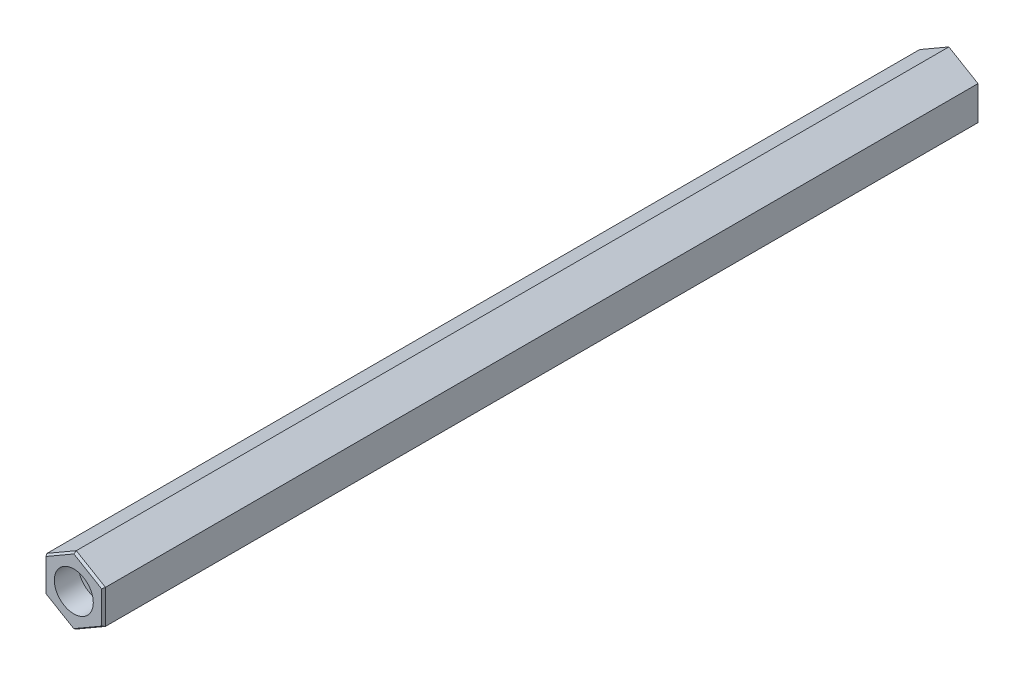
from build123d import *
from OCP.BRepFilletAPI import BRepFilletAPI_MakeChamfer

# Parameters (mm, degrees)
BASE_EXTRUSION_DEPTH    = 180
CHANFREIN1_SIZE         = 1
CHANFREIN1_SIZE2        = 0.577350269
ESQUISSE4_R             = 8
ENL_V_MAT_EXTRU_1_DEPTH = 10
ENL_V_START             = -10
ESQUISSE5_R             = 8
ENL_V_MAT_EXTRU_2_DEPTH = 10


with BuildPart() as part:
    # Esquisse1 → Base-Extrusion (new, symmetric)
    with BuildSketch(Plane.XY):
        Polygon((12, 6.95), (12, -6.95), (-0.028381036, -13.916207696), (-12, -6.852898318), (-12, 7.047101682), (0.028381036, 14.013309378), align=None)
    extrude(amount=BASE_EXTRUSION_DEPTH, both=True)

    # Chanfrein1: one chamfer whose edges measure the first distance from different faces: ONE call of the kernel's chamfer builder (chamfer() names one face for all edges)
    chanfrein1_edges_1 = [part.edges().sort_by_distance(p)[0] for p in [
        (5.985809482, -10.433103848, -180),
        (12, 0, -180),
        (6.014190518, 10.481654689, -180),
        (-5.985809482, 10.53020553, -180),
        (-12, 0.097101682, -180),
        (-6.014190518, -10.384553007, -180),
    ]]
    chanfrein1_side_1 = [part.faces().sort_by_distance(p)[0] for p in [
        (0, 0.048550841, -180),
    ]]
    chanfrein1_edges_2 = [part.edges().sort_by_distance(p)[0] for p in [
        (-5.985809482, 10.53020553, 180),
    ]]
    chanfrein1_side_2 = [part.faces().sort_by_distance(p)[0] for p in [
        (-5.985809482, 10.53020553, 0),
    ]]
    chanfrein1_edges_3 = [part.edges().sort_by_distance(p)[0] for p in [
        (6.014190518, 10.481654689, 180),
    ]]
    chanfrein1_side_3 = [part.faces().sort_by_distance(p)[0] for p in [
        (6.014190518, 10.481654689, 0),
    ]]
    chanfrein1_edges_4 = [part.edges().sort_by_distance(p)[0] for p in [
        (12, 0, 180),
    ]]
    chanfrein1_side_4 = [part.faces().sort_by_distance(p)[0] for p in [
        (12, 0, 0),
    ]]
    chanfrein1_edges_5 = [part.edges().sort_by_distance(p)[0] for p in [
        (5.985809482, -10.433103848, 180),
    ]]
    chanfrein1_side_5 = [part.faces().sort_by_distance(p)[0] for p in [
        (5.985809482, -10.433103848, 0),
    ]]
    chanfrein1_edges_6 = [part.edges().sort_by_distance(p)[0] for p in [
        (-6.014190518, -10.384553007, 180),
    ]]
    chanfrein1_side_6 = [part.faces().sort_by_distance(p)[0] for p in [
        (-6.014190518, -10.384553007, 0),
    ]]
    chanfrein1_edges_7 = [part.edges().sort_by_distance(p)[0] for p in [
        (-12, 0.097101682, 180),
    ]]
    chanfrein1_side_7 = [part.faces().sort_by_distance(p)[0] for p in [
        (-12, 0.097101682, 0),
    ]]
    chanfrein1 = BRepFilletAPI_MakeChamfer(part.part.solid().wrapped)
    for e in chanfrein1_edges_1:
        chanfrein1.Add(CHANFREIN1_SIZE, CHANFREIN1_SIZE2, e.wrapped, chanfrein1_side_1[0].wrapped)  # the first distance lies on this face
    for e in chanfrein1_edges_2:
        chanfrein1.Add(CHANFREIN1_SIZE, CHANFREIN1_SIZE2, e.wrapped, chanfrein1_side_2[0].wrapped)  # the first distance lies on this face
    for e in chanfrein1_edges_3:
        chanfrein1.Add(CHANFREIN1_SIZE, CHANFREIN1_SIZE2, e.wrapped, chanfrein1_side_3[0].wrapped)  # the first distance lies on this face
    for e in chanfrein1_edges_4:
        chanfrein1.Add(CHANFREIN1_SIZE, CHANFREIN1_SIZE2, e.wrapped, chanfrein1_side_4[0].wrapped)  # the first distance lies on this face
    for e in chanfrein1_edges_5:
        chanfrein1.Add(CHANFREIN1_SIZE, CHANFREIN1_SIZE2, e.wrapped, chanfrein1_side_5[0].wrapped)  # the first distance lies on this face
    for e in chanfrein1_edges_6:
        chanfrein1.Add(CHANFREIN1_SIZE, CHANFREIN1_SIZE2, e.wrapped, chanfrein1_side_6[0].wrapped)  # the first distance lies on this face
    for e in chanfrein1_edges_7:
        chanfrein1.Add(CHANFREIN1_SIZE, CHANFREIN1_SIZE2, e.wrapped, chanfrein1_side_7[0].wrapped)  # the first distance lies on this face
    add(Compound.cast(chanfrein1.Shape()), mode=Mode.REPLACE)

    # Esquisse4 → Enl_v. mat.-Extru.1 (cut)
    with BuildSketch(Plane(origin=(0, 0, -180), x_dir=(-1, 0, 0), z_dir=(0, 0, -1))):
        Circle(ESQUISSE4_R)
    extrude(amount=-ENL_V_MAT_EXTRU_1_DEPTH, mode=Mode.SUBTRACT)

    # Esquisse5 → Enl_v. mat.-Extru.2 (cut)
    with BuildSketch(Plane.XY.offset(180).offset(ENL_V_START)):
        with Locations(Location((0, 0, 0), (0, 0, 180))):
            Circle(ESQUISSE5_R)
    extrude(amount=ENL_V_MAT_EXTRU_2_DEPTH, mode=Mode.SUBTRACT)


solid = part.part
